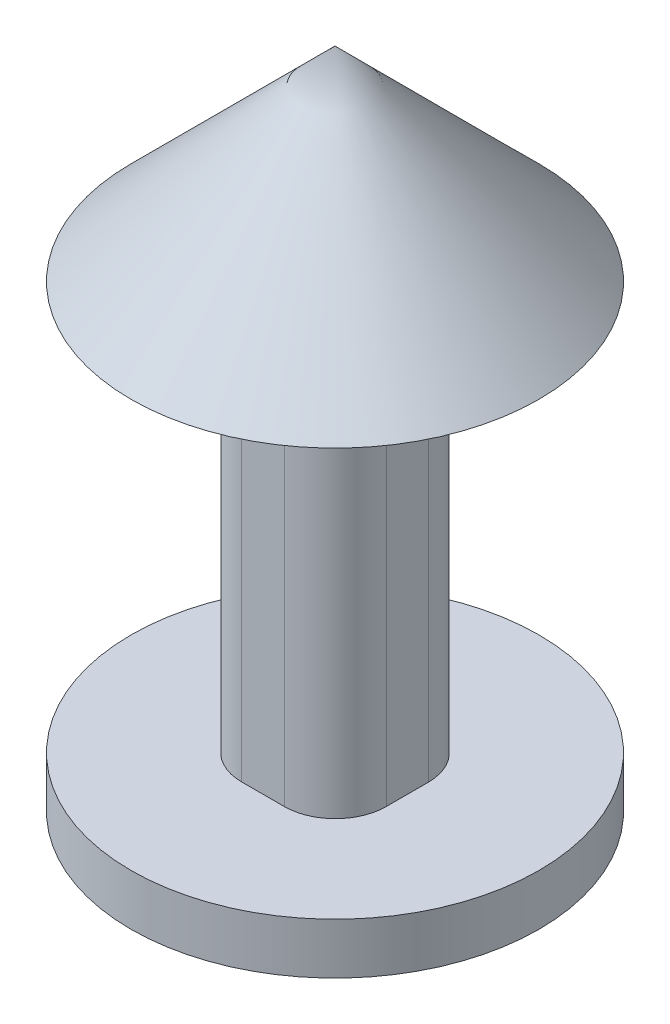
ISO-10303-21;
HEADER;
FILE_DESCRIPTION(('STEP AP214'),'2;1');
FILE_NAME('part.step','',(''),(''),'','','');
FILE_SCHEMA(('AUTOMOTIVE_DESIGN { 1 0 10303 214 1 1 1 1 }'));
ENDSEC;
DATA;
#1=APPLICATION_CONTEXT('core data for automotive mechanical design processes');
#2=APPLICATION_PROTOCOL_DEFINITION('international standard','automotive_design',2000,#1);
#3=PRODUCT_CONTEXT('',#1,'mechanical');
#4=PRODUCT('Part','Part','',(#3));
#5=PRODUCT_RELATED_PRODUCT_CATEGORY('part','',(#4));
#6=PRODUCT_DEFINITION_FORMATION('','',#4);
#7=PRODUCT_DEFINITION_CONTEXT('part definition',#1,'design');
#8=PRODUCT_DEFINITION('design','',#6,#7);
#9=PRODUCT_DEFINITION_SHAPE('','',#8);
#10=(LENGTH_UNIT() NAMED_UNIT(*) SI_UNIT(.MILLI.,.METRE.));
#11=(NAMED_UNIT(*) PLANE_ANGLE_UNIT() SI_UNIT($,.RADIAN.));
#12=(NAMED_UNIT(*) SI_UNIT($,.STERADIAN.) SOLID_ANGLE_UNIT());
#13=UNCERTAINTY_MEASURE_WITH_UNIT(LENGTH_MEASURE(1.E-05),#10,'distance_accuracy_value','');
#14=(GEOMETRIC_REPRESENTATION_CONTEXT(3) GLOBAL_UNCERTAINTY_ASSIGNED_CONTEXT((#13)) GLOBAL_UNIT_ASSIGNED_CONTEXT((#10,
#11,#12)) REPRESENTATION_CONTEXT('',''));
#15=CARTESIAN_POINT('',(0.,0.,0.));
#16=DIRECTION('',(0.,0.,1.));
#17=DIRECTION('',(1.,0.,0.));
#18=AXIS2_PLACEMENT_3D('',#15,#16,#17);
#19=CARTESIAN_POINT('',(0.,25.4,0.));
#20=DIRECTION('',(0.,1.,0.));
#21=DIRECTION('',(0.,0.,1.));
#22=AXIS2_PLACEMENT_3D('',#19,#20,#21);
#23=PLANE('',#22);
#24=CARTESIAN_POINT('',(0.,25.4,0.));
#25=DIRECTION('',(0.,1.,0.));
#26=DIRECTION('',(0.,0.,1.));
#27=AXIS2_PLACEMENT_3D('',#24,#25,#26);
#28=CIRCLE('',#27,101.6);
#29=CARTESIAN_POINT('',(0.,25.4,101.6));
#30=VERTEX_POINT('',#29);
#31=EDGE_CURVE('E13',#30,#30,#28,.T.);
#32=ORIENTED_EDGE('',*,*,#31,.T.);
#33=EDGE_LOOP('',(#32));
#34=FACE_BOUND('',#33,.T.);
#35=DIRECTION('',(1.,0.,0.));
#36=VECTOR('',#35,1.);
#37=CARTESIAN_POINT('',(-10.5901696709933,25.4,35.8517459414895));
#38=LINE('',#37,#36);
#39=CARTESIAN_POINT('',(-10.5901696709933,25.4,35.8517459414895));
#40=VERTEX_POINT('',#39);
#41=CARTESIAN_POINT('',(10.5901696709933,25.4,35.8517459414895));
#42=VERTEX_POINT('',#41);
#43=EDGE_CURVE('E158',#40,#42,#38,.T.);
#44=ORIENTED_EDGE('',*,*,#43,.F.);
#45=CARTESIAN_POINT('',(-10.5901696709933,25.4,10.4517459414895));
#46=DIRECTION('',(0.,1.,0.));
#47=DIRECTION('',(0.,0.,-1.));
#48=AXIS2_PLACEMENT_3D('',#45,#46,#47);
#49=CIRCLE('',#48,25.4);
#50=CARTESIAN_POINT('',(-35.9901696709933,25.4,10.4517459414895));
#51=VERTEX_POINT('',#50);
#52=EDGE_CURVE('E155',#51,#40,#49,.T.);
#53=ORIENTED_EDGE('',*,*,#52,.F.);
#54=DIRECTION('',(0.,0.,1.));
#55=VECTOR('',#54,1.);
#56=CARTESIAN_POINT('',(-35.9901696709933,25.4,10.4517459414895));
#57=LINE('',#56,#55);
#58=CARTESIAN_POINT('',(-35.9901696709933,25.4,-10.4517459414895));
#59=VERTEX_POINT('',#58);
#60=EDGE_CURVE('E95',#59,#51,#57,.T.);
#61=ORIENTED_EDGE('',*,*,#60,.F.);
#62=CARTESIAN_POINT('',(-10.5901696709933,25.4,-10.4517459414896));
#63=DIRECTION('',(0.,1.,0.));
#64=DIRECTION('',(0.,0.,-1.));
#65=AXIS2_PLACEMENT_3D('',#62,#63,#64);
#66=CIRCLE('',#65,25.4);
#67=CARTESIAN_POINT('',(-10.5901696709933,25.4,-35.8517459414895));
#68=VERTEX_POINT('',#67);
#69=EDGE_CURVE('E168',#68,#59,#66,.T.);
#70=ORIENTED_EDGE('',*,*,#69,.F.);
#71=DIRECTION('',(-1.,0.,0.));
#72=VECTOR('',#71,1.);
#73=CARTESIAN_POINT('',(-10.5901696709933,25.4,-35.8517459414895));
#74=LINE('',#73,#72);
#75=CARTESIAN_POINT('',(10.5901696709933,25.4,-35.8517459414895));
#76=VERTEX_POINT('',#75);
#77=EDGE_CURVE('E166',#76,#68,#74,.T.);
#78=ORIENTED_EDGE('',*,*,#77,.F.);
#79=CARTESIAN_POINT('',(10.5901696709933,25.4,-10.4517459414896));
#80=DIRECTION('',(0.,1.,0.));
#81=DIRECTION('',(0.,0.,-1.));
#82=AXIS2_PLACEMENT_3D('',#79,#80,#81);
#83=CIRCLE('',#82,25.4);
#84=CARTESIAN_POINT('',(35.9901696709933,25.4,-10.4517459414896));
#85=VERTEX_POINT('',#84);
#86=EDGE_CURVE('E126',#85,#76,#83,.T.);
#87=ORIENTED_EDGE('',*,*,#86,.F.);
#88=DIRECTION('',(0.,0.,-1.));
#89=VECTOR('',#88,1.);
#90=CARTESIAN_POINT('',(35.9901696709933,25.4,10.4517459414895));
#91=LINE('',#90,#89);
#92=CARTESIAN_POINT('',(35.9901696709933,25.4,10.4517459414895));
#93=VERTEX_POINT('',#92);
#94=EDGE_CURVE('E163',#93,#85,#91,.T.);
#95=ORIENTED_EDGE('',*,*,#94,.F.);
#96=CARTESIAN_POINT('',(10.5901696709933,25.4,10.4517459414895));
#97=DIRECTION('',(0.,1.,0.));
#98=DIRECTION('',(0.,0.,1.));
#99=AXIS2_PLACEMENT_3D('',#96,#97,#98);
#100=CIRCLE('',#99,25.4);
#101=EDGE_CURVE('E161',#42,#93,#100,.T.);
#102=ORIENTED_EDGE('',*,*,#101,.F.);
#103=EDGE_LOOP('',(#44,#53,#61,#70,#78,#87,#95,#102));
#104=FACE_BOUND('',#103,.T.);
#105=ADVANCED_FACE('F47',(#34,#104),#23,.T.);
#106=CARTESIAN_POINT('',(0.,25.4,0.));
#107=DIRECTION('',(0.,-1.,0.));
#108=DIRECTION('',(0.,0.,-1.));
#109=AXIS2_PLACEMENT_3D('',#106,#107,#108);
#110=CYLINDRICAL_SURFACE('',#109,101.6);
#111=ORIENTED_EDGE('',*,*,#31,.F.);
#112=EDGE_LOOP('',(#111));
#113=FACE_BOUND('',#112,.T.);
#114=CARTESIAN_POINT('',(0.,0.,0.));
#115=DIRECTION('',(0.,1.,0.));
#116=DIRECTION('',(0.,0.,1.));
#117=AXIS2_PLACEMENT_3D('',#114,#115,#116);
#118=CIRCLE('',#117,101.6);
#119=CARTESIAN_POINT('',(0.,0.,101.6));
#120=VERTEX_POINT('',#119);
#121=EDGE_CURVE('E51',#120,#120,#118,.T.);
#122=ORIENTED_EDGE('',*,*,#121,.T.);
#123=EDGE_LOOP('',(#122));
#124=FACE_BOUND('',#123,.T.);
#125=ADVANCED_FACE('F49',(#113,#124),#110,.T.);
#126=CARTESIAN_POINT('',(0.,0.,0.));
#127=DIRECTION('',(0.,1.,0.));
#128=DIRECTION('',(0.,0.,1.));
#129=AXIS2_PLACEMENT_3D('',#126,#127,#128);
#130=PLANE('',#129);
#131=ORIENTED_EDGE('',*,*,#121,.F.);
#132=EDGE_LOOP('',(#131));
#133=FACE_BOUND('',#132,.T.);
#134=ADVANCED_FACE('F187',(#133),#130,.F.);
#135=CARTESIAN_POINT('',(-10.5901696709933,228.6,10.4517459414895));
#136=DIRECTION('',(0.,-1.,0.));
#137=DIRECTION('',(0.,0.,-1.));
#138=AXIS2_PLACEMENT_3D('',#135,#136,#137);
#139=CYLINDRICAL_SURFACE('',#138,25.4);
#140=ORIENTED_EDGE('',*,*,#52,.T.);
#141=DIRECTION('',(0.,-1.,0.));
#142=VECTOR('',#141,1.);
#143=CARTESIAN_POINT('',(-10.5901696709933,228.6,35.8517459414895));
#144=LINE('',#143,#142);
#145=CARTESIAN_POINT('',(-10.5901696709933,228.6,35.8517459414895));
#146=VERTEX_POINT('',#145);
#147=EDGE_CURVE('E182',#146,#40,#144,.T.);
#148=ORIENTED_EDGE('',*,*,#147,.F.);
#149=CARTESIAN_POINT('',(-10.5901696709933,228.6,10.4517459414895));
#150=DIRECTION('',(0.,1.,0.));
#151=DIRECTION('',(0.,0.,-1.));
#152=AXIS2_PLACEMENT_3D('',#149,#150,#151);
#153=CIRCLE('',#152,25.4);
#154=CARTESIAN_POINT('',(-35.9901696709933,228.6,10.4517459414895));
#155=VERTEX_POINT('',#154);
#156=EDGE_CURVE('E171',#155,#146,#153,.T.);
#157=ORIENTED_EDGE('',*,*,#156,.F.);
#158=DIRECTION('',(0.,-1.,0.));
#159=VECTOR('',#158,1.);
#160=CARTESIAN_POINT('',(-35.9901696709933,228.6,10.4517459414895));
#161=LINE('',#160,#159);
#162=EDGE_CURVE('E154',#155,#51,#161,.T.);
#163=ORIENTED_EDGE('',*,*,#162,.T.);
#164=EDGE_LOOP('',(#140,#148,#157,#163));
#165=FACE_BOUND('',#164,.T.);
#166=ADVANCED_FACE('F189',(#165),#139,.T.);
#167=CARTESIAN_POINT('',(-10.5901696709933,228.6,35.8517459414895));
#168=DIRECTION('',(0.,0.,-1.));
#169=DIRECTION('',(-1.,0.,0.));
#170=AXIS2_PLACEMENT_3D('',#167,#168,#169);
#171=PLANE('',#170);
#172=ORIENTED_EDGE('',*,*,#43,.T.);
#173=DIRECTION('',(0.,-1.,0.));
#174=VECTOR('',#173,1.);
#175=CARTESIAN_POINT('',(10.5901696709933,228.6,35.8517459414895));
#176=LINE('',#175,#174);
#177=CARTESIAN_POINT('',(10.5901696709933,228.6,35.8517459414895));
#178=VERTEX_POINT('',#177);
#179=EDGE_CURVE('E179',#178,#42,#176,.T.);
#180=ORIENTED_EDGE('',*,*,#179,.F.);
#181=DIRECTION('',(1.,0.,0.));
#182=VECTOR('',#181,1.);
#183=CARTESIAN_POINT('',(-10.5901696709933,228.6,35.8517459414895));
#184=LINE('',#183,#182);
#185=EDGE_CURVE('E103',#146,#178,#184,.T.);
#186=ORIENTED_EDGE('',*,*,#185,.F.);
#187=ORIENTED_EDGE('',*,*,#147,.T.);
#188=EDGE_LOOP('',(#172,#180,#186,#187));
#189=FACE_BOUND('',#188,.T.);
#190=ADVANCED_FACE('F194',(#189),#171,.F.);
#191=CARTESIAN_POINT('',(10.5901696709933,228.6,10.4517459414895));
#192=DIRECTION('',(0.,-1.,0.));
#193=DIRECTION('',(0.,0.,-1.));
#194=AXIS2_PLACEMENT_3D('',#191,#192,#193);
#195=CYLINDRICAL_SURFACE('',#194,25.4);
#196=ORIENTED_EDGE('',*,*,#101,.T.);
#197=DIRECTION('',(0.,-1.,0.));
#198=VECTOR('',#197,1.);
#199=CARTESIAN_POINT('',(35.9901696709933,228.6,10.4517459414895));
#200=LINE('',#199,#198);
#201=CARTESIAN_POINT('',(35.9901696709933,228.6,10.4517459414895));
#202=VERTEX_POINT('',#201);
#203=EDGE_CURVE('E176',#202,#93,#200,.T.);
#204=ORIENTED_EDGE('',*,*,#203,.F.);
#205=CARTESIAN_POINT('',(10.5901696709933,228.6,10.4517459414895));
#206=DIRECTION('',(0.,1.,0.));
#207=DIRECTION('',(0.,0.,1.));
#208=AXIS2_PLACEMENT_3D('',#205,#206,#207);
#209=CIRCLE('',#208,25.4);
#210=EDGE_CURVE('E146',#178,#202,#209,.T.);
#211=ORIENTED_EDGE('',*,*,#210,.F.);
#212=ORIENTED_EDGE('',*,*,#179,.T.);
#213=EDGE_LOOP('',(#196,#204,#211,#212));
#214=FACE_BOUND('',#213,.T.);
#215=ADVANCED_FACE('F207',(#214),#195,.T.);
#216=CARTESIAN_POINT('',(35.9901696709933,228.6,10.4517459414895));
#217=DIRECTION('',(-1.,0.,0.));
#218=DIRECTION('',(0.,0.,1.));
#219=AXIS2_PLACEMENT_3D('',#216,#217,#218);
#220=PLANE('',#219);
#221=ORIENTED_EDGE('',*,*,#94,.T.);
#222=DIRECTION('',(0.,-1.,0.));
#223=VECTOR('',#222,1.);
#224=CARTESIAN_POINT('',(35.9901696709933,228.6,-10.4517459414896));
#225=LINE('',#224,#223);
#226=CARTESIAN_POINT('',(35.9901696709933,228.6,-10.4517459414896));
#227=VERTEX_POINT('',#226);
#228=EDGE_CURVE('E129',#227,#85,#225,.T.);
#229=ORIENTED_EDGE('',*,*,#228,.F.);
#230=DIRECTION('',(0.,0.,-1.));
#231=VECTOR('',#230,1.);
#232=CARTESIAN_POINT('',(35.9901696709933,228.6,10.4517459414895));
#233=LINE('',#232,#231);
#234=EDGE_CURVE('E144',#202,#227,#233,.T.);
#235=ORIENTED_EDGE('',*,*,#234,.F.);
#236=ORIENTED_EDGE('',*,*,#203,.T.);
#237=EDGE_LOOP('',(#221,#229,#235,#236));
#238=FACE_BOUND('',#237,.T.);
#239=ADVANCED_FACE('F210',(#238),#220,.F.);
#240=CARTESIAN_POINT('',(10.5901696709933,228.6,-10.4517459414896));
#241=DIRECTION('',(0.,-1.,0.));
#242=DIRECTION('',(0.,0.,-1.));
#243=AXIS2_PLACEMENT_3D('',#240,#241,#242);
#244=CYLINDRICAL_SURFACE('',#243,25.4);
#245=ORIENTED_EDGE('',*,*,#86,.T.);
#246=DIRECTION('',(0.,-1.,0.));
#247=VECTOR('',#246,1.);
#248=CARTESIAN_POINT('',(10.5901696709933,228.6,-35.8517459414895));
#249=LINE('',#248,#247);
#250=CARTESIAN_POINT('',(10.5901696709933,228.6,-35.8517459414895));
#251=VERTEX_POINT('',#250);
#252=EDGE_CURVE('E118',#251,#76,#249,.T.);
#253=ORIENTED_EDGE('',*,*,#252,.F.);
#254=CARTESIAN_POINT('',(10.5901696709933,228.6,-10.4517459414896));
#255=DIRECTION('',(0.,1.,0.));
#256=DIRECTION('',(0.,0.,-1.));
#257=AXIS2_PLACEMENT_3D('',#254,#255,#256);
#258=CIRCLE('',#257,25.4);
#259=EDGE_CURVE('E123',#227,#251,#258,.T.);
#260=ORIENTED_EDGE('',*,*,#259,.F.);
#261=ORIENTED_EDGE('',*,*,#228,.T.);
#262=EDGE_LOOP('',(#245,#253,#260,#261));
#263=FACE_BOUND('',#262,.T.);
#264=ADVANCED_FACE('F120',(#263),#244,.T.);
#265=CARTESIAN_POINT('',(-10.5901696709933,228.6,-35.8517459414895));
#266=DIRECTION('',(0.,0.,1.));
#267=DIRECTION('',(1.,0.,0.));
#268=AXIS2_PLACEMENT_3D('',#265,#266,#267);
#269=PLANE('',#268);
#270=ORIENTED_EDGE('',*,*,#77,.T.);
#271=DIRECTION('',(0.,-1.,0.));
#272=VECTOR('',#271,1.);
#273=CARTESIAN_POINT('',(-10.5901696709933,228.6,-35.8517459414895));
#274=LINE('',#273,#272);
#275=CARTESIAN_POINT('',(-10.5901696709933,228.6,-35.8517459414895));
#276=VERTEX_POINT('',#275);
#277=EDGE_CURVE('E130',#276,#68,#274,.T.);
#278=ORIENTED_EDGE('',*,*,#277,.F.);
#279=DIRECTION('',(-1.,0.,0.));
#280=VECTOR('',#279,1.);
#281=CARTESIAN_POINT('',(-10.5901696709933,228.6,-35.8517459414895));
#282=LINE('',#281,#280);
#283=EDGE_CURVE('E133',#251,#276,#282,.T.);
#284=ORIENTED_EDGE('',*,*,#283,.F.);
#285=ORIENTED_EDGE('',*,*,#252,.T.);
#286=EDGE_LOOP('',(#270,#278,#284,#285));
#287=FACE_BOUND('',#286,.T.);
#288=ADVANCED_FACE('F134',(#287),#269,.F.);
#289=CARTESIAN_POINT('',(-10.5901696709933,228.6,-10.4517459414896));
#290=DIRECTION('',(0.,-1.,0.));
#291=DIRECTION('',(0.,0.,-1.));
#292=AXIS2_PLACEMENT_3D('',#289,#290,#291);
#293=CYLINDRICAL_SURFACE('',#292,25.4);
#294=ORIENTED_EDGE('',*,*,#69,.T.);
#295=DIRECTION('',(0.,-1.,0.));
#296=VECTOR('',#295,1.);
#297=CARTESIAN_POINT('',(-35.9901696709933,228.6,-10.4517459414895));
#298=LINE('',#297,#296);
#299=CARTESIAN_POINT('',(-35.9901696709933,228.6,-10.4517459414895));
#300=VERTEX_POINT('',#299);
#301=EDGE_CURVE('E62',#300,#59,#298,.T.);
#302=ORIENTED_EDGE('',*,*,#301,.F.);
#303=CARTESIAN_POINT('',(-10.5901696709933,228.6,-10.4517459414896));
#304=DIRECTION('',(0.,1.,0.));
#305=DIRECTION('',(0.,0.,-1.));
#306=AXIS2_PLACEMENT_3D('',#303,#304,#305);
#307=CIRCLE('',#306,25.4);
#308=EDGE_CURVE('E138',#276,#300,#307,.T.);
#309=ORIENTED_EDGE('',*,*,#308,.F.);
#310=ORIENTED_EDGE('',*,*,#277,.T.);
#311=EDGE_LOOP('',(#294,#302,#309,#310));
#312=FACE_BOUND('',#311,.T.);
#313=ADVANCED_FACE('F219',(#312),#293,.T.);
#314=CARTESIAN_POINT('',(-35.9901696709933,228.6,10.4517459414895));
#315=DIRECTION('',(1.,0.,0.));
#316=DIRECTION('',(0.,0.,-1.));
#317=AXIS2_PLACEMENT_3D('',#314,#315,#316);
#318=PLANE('',#317);
#319=ORIENTED_EDGE('',*,*,#60,.T.);
#320=ORIENTED_EDGE('',*,*,#162,.F.);
#321=DIRECTION('',(0.,0.,1.));
#322=VECTOR('',#321,1.);
#323=CARTESIAN_POINT('',(-35.9901696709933,228.6,10.4517459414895));
#324=LINE('',#323,#322);
#325=EDGE_CURVE('E151',#300,#155,#324,.T.);
#326=ORIENTED_EDGE('',*,*,#325,.F.);
#327=ORIENTED_EDGE('',*,*,#301,.T.);
#328=EDGE_LOOP('',(#319,#320,#326,#327));
#329=FACE_BOUND('',#328,.T.);
#330=ADVANCED_FACE('F222',(#329),#318,.F.);
#331=CARTESIAN_POINT('',(0.,228.6,0.));
#332=DIRECTION('',(0.,-1.,0.));
#333=DIRECTION('',(1.,0.,0.));
#334=AXIS2_PLACEMENT_3D('',#331,#332,#333);
#335=PLANE('',#334);
#336=CARTESIAN_POINT('',(0.,228.6,0.));
#337=DIRECTION('',(0.,-1.,0.));
#338=DIRECTION('',(1.,0.,0.));
#339=AXIS2_PLACEMENT_3D('',#336,#337,#338);
#340=CIRCLE('',#339,101.6);
#341=CARTESIAN_POINT('',(101.6,228.6,0.));
#342=VERTEX_POINT('',#341);
#343=EDGE_CURVE('E159',#342,#342,#340,.T.);
#344=ORIENTED_EDGE('',*,*,#343,.T.);
#345=EDGE_LOOP('',(#344));
#346=FACE_BOUND('',#345,.T.);
#347=ORIENTED_EDGE('',*,*,#156,.T.);
#348=ORIENTED_EDGE('',*,*,#185,.T.);
#349=ORIENTED_EDGE('',*,*,#210,.T.);
#350=ORIENTED_EDGE('',*,*,#234,.T.);
#351=ORIENTED_EDGE('',*,*,#259,.T.);
#352=ORIENTED_EDGE('',*,*,#283,.T.);
#353=ORIENTED_EDGE('',*,*,#308,.T.);
#354=ORIENTED_EDGE('',*,*,#325,.T.);
#355=EDGE_LOOP('',(#347,#348,#349,#350,#351,#352,#353,#354));
#356=FACE_BOUND('',#355,.T.);
#357=ADVANCED_FACE('F141',(#346,#356),#335,.T.);
#358=CARTESIAN_POINT('',(0.,228.6,0.));
#359=DIRECTION('',(0.,-1.,0.));
#360=DIRECTION('',(1.,0.,0.));
#361=AXIS2_PLACEMENT_3D('',#358,#359,#360);
#362=CONICAL_SURFACE('',#361,101.6,0.785398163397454);
#363=CARTESIAN_POINT('',(0.,330.199999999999,0.));
#364=VERTEX_POINT('',#363);
#365=VERTEX_LOOP('',#364);
#366=FACE_BOUND('',#365,.T.);
#367=ORIENTED_EDGE('',*,*,#343,.F.);
#368=EDGE_LOOP('',(#367));
#369=FACE_BOUND('',#368,.T.);
#370=ADVANCED_FACE('F227',(#366,#369),#362,.T.);
#371=CLOSED_SHELL('',(#105,#125,#134,#166,#190,#215,#239,#264,#288,#313,#330,#357,#370));
#372=MANIFOLD_SOLID_BREP('B2',#371);
#373=ADVANCED_BREP_SHAPE_REPRESENTATION('',(#18,#372),#14);
#374=SHAPE_DEFINITION_REPRESENTATION(#9,#373);
ENDSEC;
END-ISO-10303-21;
